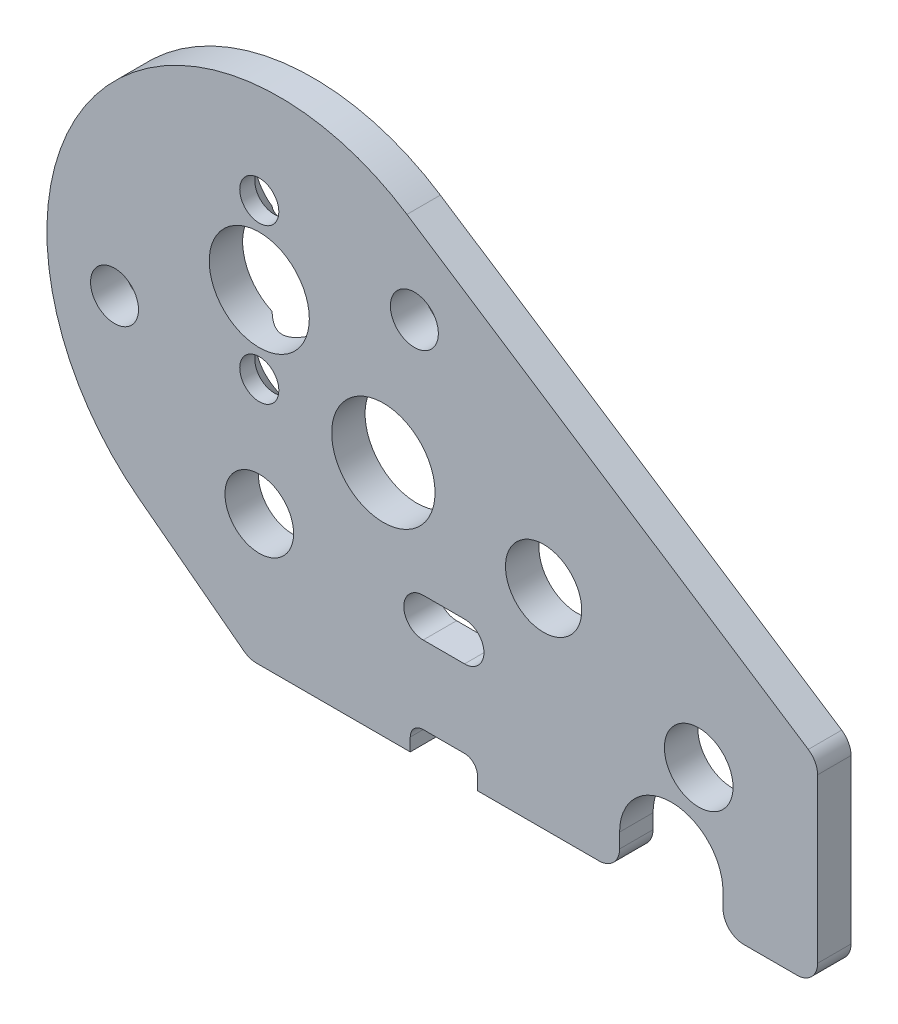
ISO-10303-21;
HEADER;
FILE_DESCRIPTION(('STEP AP214'),'2;1');
FILE_NAME('part.step','',(''),(''),'','','');
FILE_SCHEMA(('AUTOMOTIVE_DESIGN { 1 0 10303 214 1 1 1 1 }'));
ENDSEC;
DATA;
#1=APPLICATION_CONTEXT('core data for automotive mechanical design processes');
#2=APPLICATION_PROTOCOL_DEFINITION('international standard','automotive_design',2000,#1);
#3=PRODUCT_CONTEXT('',#1,'mechanical');
#4=PRODUCT('Part','Part','',(#3));
#5=PRODUCT_RELATED_PRODUCT_CATEGORY('part','',(#4));
#6=PRODUCT_DEFINITION_FORMATION('','',#4);
#7=PRODUCT_DEFINITION_CONTEXT('part definition',#1,'design');
#8=PRODUCT_DEFINITION('design','',#6,#7);
#9=PRODUCT_DEFINITION_SHAPE('','',#8);
#10=(LENGTH_UNIT() NAMED_UNIT(*) SI_UNIT(.MILLI.,.METRE.));
#11=(NAMED_UNIT(*) PLANE_ANGLE_UNIT() SI_UNIT($,.RADIAN.));
#12=(NAMED_UNIT(*) SI_UNIT($,.STERADIAN.) SOLID_ANGLE_UNIT());
#13=UNCERTAINTY_MEASURE_WITH_UNIT(LENGTH_MEASURE(1.E-05),#10,'distance_accuracy_value','');
#14=(GEOMETRIC_REPRESENTATION_CONTEXT(3) GLOBAL_UNCERTAINTY_ASSIGNED_CONTEXT((#13)) GLOBAL_UNIT_ASSIGNED_CONTEXT((#10,
#11,#12)) REPRESENTATION_CONTEXT('',''));
#15=CARTESIAN_POINT('',(0.,0.,0.));
#16=DIRECTION('',(0.,0.,1.));
#17=DIRECTION('',(1.,0.,0.));
#18=AXIS2_PLACEMENT_3D('',#15,#16,#17);
#19=CARTESIAN_POINT('',(34.29,-19.939,-2.05232));
#20=DIRECTION('',(0.,-1.,0.));
#21=DIRECTION('',(1.,0.,0.));
#22=AXIS2_PLACEMENT_3D('',#19,#20,#21);
#23=PLANE('',#22);
#24=DIRECTION('',(0.,0.,-1.));
#25=VECTOR('',#24,1.);
#26=CARTESIAN_POINT('',(9.27174263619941,-19.939,0.));
#27=LINE('',#26,#25);
#28=CARTESIAN_POINT('',(9.27174263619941,-19.939,0.));
#29=VERTEX_POINT('',#28);
#30=CARTESIAN_POINT('',(9.27174263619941,-19.939,-2.05232));
#31=VERTEX_POINT('',#30);
#32=EDGE_CURVE('E257',#29,#31,#27,.T.);
#33=ORIENTED_EDGE('',*,*,#32,.F.);
#34=DIRECTION('',(1.,0.,0.));
#35=VECTOR('',#34,1.);
#36=CARTESIAN_POINT('',(34.29,-19.939,0.));
#37=LINE('',#36,#35);
#38=CARTESIAN_POINT('',(-0.174773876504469,-19.939,0.));
#39=VERTEX_POINT('',#38);
#40=EDGE_CURVE('E401',#39,#29,#37,.T.);
#41=ORIENTED_EDGE('',*,*,#40,.F.);
#42=DIRECTION('',(0.,0.,1.));
#43=VECTOR('',#42,1.);
#44=CARTESIAN_POINT('',(-0.174773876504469,-19.939,-2.05232));
#45=LINE('',#44,#43);
#46=CARTESIAN_POINT('',(-0.174773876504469,-19.939,-2.05232));
#47=VERTEX_POINT('',#46);
#48=EDGE_CURVE('E530',#39,#47,#45,.F.);
#49=ORIENTED_EDGE('',*,*,#48,.T.);
#50=DIRECTION('',(1.,0.,0.));
#51=VECTOR('',#50,1.);
#52=CARTESIAN_POINT('',(34.29,-19.939,-2.05232));
#53=LINE('',#52,#51);
#54=EDGE_CURVE('E385',#47,#31,#53,.T.);
#55=ORIENTED_EDGE('',*,*,#54,.T.);
#56=EDGE_LOOP('',(#33,#41,#49,#55));
#57=FACE_BOUND('',#56,.T.);
#58=ADVANCED_FACE('F42',(#57),#23,.T.);
#59=CARTESIAN_POINT('',(29.7504926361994,-19.939,-2.05232));
#60=VERTEX_POINT('',#59);
#61=CARTESIAN_POINT('',(33.02,-19.939,-2.05232));
#62=VERTEX_POINT('',#61);
#63=EDGE_CURVE('E384',#60,#62,#53,.T.);
#64=ORIENTED_EDGE('',*,*,#63,.T.);
#65=DIRECTION('',(0.,0.,1.));
#66=VECTOR('',#65,1.);
#67=CARTESIAN_POINT('',(33.02,-19.939,-2.05232));
#68=LINE('',#67,#66);
#69=CARTESIAN_POINT('',(33.02,-19.939,0.));
#70=VERTEX_POINT('',#69);
#71=EDGE_CURVE('E492',#62,#70,#68,.T.);
#72=ORIENTED_EDGE('',*,*,#71,.T.);
#73=CARTESIAN_POINT('',(29.7504926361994,-19.939,0.));
#74=VERTEX_POINT('',#73);
#75=EDGE_CURVE('E400',#74,#70,#37,.T.);
#76=ORIENTED_EDGE('',*,*,#75,.F.);
#77=DIRECTION('',(0.,0.,1.));
#78=VECTOR('',#77,1.);
#79=CARTESIAN_POINT('',(29.7504926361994,-19.939,-2.05232));
#80=LINE('',#79,#78);
#81=EDGE_CURVE('E495',#74,#60,#80,.F.);
#82=ORIENTED_EDGE('',*,*,#81,.T.);
#83=EDGE_LOOP('',(#64,#72,#76,#82));
#84=FACE_BOUND('',#83,.T.);
#85=ADVANCED_FACE('F451',(#84),#23,.T.);
#86=CARTESIAN_POINT('',(1.2446,-3.4036,-2.05232));
#87=DIRECTION('',(0.,0.,1.));
#88=DIRECTION('',(1.,0.,0.));
#89=AXIS2_PLACEMENT_3D('',#86,#87,#88);
#90=PLANE('',#89);
#91=DIRECTION('',(-1.,0.,0.));
#92=VECTOR('',#91,1.);
#93=CARTESIAN_POINT('',(12.6054926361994,-13.589,-2.05232));
#94=LINE('',#93,#92);
#95=CARTESIAN_POINT('',(12.6054926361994,-13.589,-2.05232));
#96=VERTEX_POINT('',#95);
#97=CARTESIAN_POINT('',(10.0654926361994,-13.589,-2.05232));
#98=VERTEX_POINT('',#97);
#99=EDGE_CURVE('E280',#96,#98,#94,.T.);
#100=ORIENTED_EDGE('',*,*,#99,.F.);
#101=CARTESIAN_POINT('',(12.6054926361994,-12.398375,-2.05232));
#102=DIRECTION('',(0.,0.,-1.));
#103=DIRECTION('',(-1.,0.,0.));
#104=AXIS2_PLACEMENT_3D('',#101,#102,#103);
#105=CIRCLE('',#104,1.190625);
#106=CARTESIAN_POINT('',(12.6054926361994,-11.20775,-2.05232));
#107=VERTEX_POINT('',#106);
#108=EDGE_CURVE('E65',#107,#96,#105,.T.);
#109=ORIENTED_EDGE('',*,*,#108,.F.);
#110=DIRECTION('',(1.,0.,0.));
#111=VECTOR('',#110,1.);
#112=CARTESIAN_POINT('',(12.6054926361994,-11.20775,-2.05232));
#113=LINE('',#112,#111);
#114=CARTESIAN_POINT('',(10.0654926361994,-11.20775,-2.05232));
#115=VERTEX_POINT('',#114);
#116=EDGE_CURVE('E269',#115,#107,#113,.T.);
#117=ORIENTED_EDGE('',*,*,#116,.F.);
#118=CARTESIAN_POINT('',(10.0654926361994,-12.398375,-2.05232));
#119=DIRECTION('',(0.,0.,-1.));
#120=DIRECTION('',(-1.,0.,0.));
#121=AXIS2_PLACEMENT_3D('',#118,#119,#120);
#122=CIRCLE('',#121,1.190625);
#123=EDGE_CURVE('E283',#98,#115,#122,.T.);
#124=ORIENTED_EDGE('',*,*,#123,.F.);
#125=EDGE_LOOP('',(#100,#109,#117,#124));
#126=FACE_BOUND('',#125,.T.);
#127=CARTESIAN_POINT('',(7.62,-5.3848,-2.05232));
#128=DIRECTION('',(0.,0.,1.));
#129=DIRECTION('',(1.,0.,0.));
#130=AXIS2_PLACEMENT_3D('',#127,#128,#129);
#131=CIRCLE('',#130,3.175);
#132=CARTESIAN_POINT('',(10.795,-5.3848,-2.05232));
#133=VERTEX_POINT('',#132);
#134=EDGE_CURVE('E317',#133,#133,#131,.T.);
#135=ORIENTED_EDGE('',*,*,#134,.T.);
#136=EDGE_LOOP('',(#135));
#137=FACE_BOUND('',#136,.T.);
#138=CARTESIAN_POINT('',(9.525,3.175,-2.05232));
#139=DIRECTION('',(0.,0.,1.));
#140=DIRECTION('',(1.,0.,0.));
#141=AXIS2_PLACEMENT_3D('',#138,#139,#140);
#142=CIRCLE('',#141,1.4732);
#143=CARTESIAN_POINT('',(10.9982,3.175,-2.05232));
#144=VERTEX_POINT('',#143);
#145=EDGE_CURVE('E325',#144,#144,#142,.T.);
#146=ORIENTED_EDGE('',*,*,#145,.T.);
#147=EDGE_LOOP('',(#146));
#148=FACE_BOUND('',#147,.T.);
#149=CARTESIAN_POINT('',(-8.89,-4.7625,-2.05232));
#150=DIRECTION('',(0.,0.,1.));
#151=DIRECTION('',(1.,0.,0.));
#152=AXIS2_PLACEMENT_3D('',#149,#150,#151);
#153=CIRCLE('',#152,1.4732);
#154=CARTESIAN_POINT('',(-7.4168,-4.7625,-2.05232));
#155=VERTEX_POINT('',#154);
#156=EDGE_CURVE('E331',#155,#155,#153,.T.);
#157=ORIENTED_EDGE('',*,*,#156,.T.);
#158=EDGE_LOOP('',(#157));
#159=FACE_BOUND('',#158,.T.);
#160=CARTESIAN_POINT('',(0.,-11.90625,-2.05232));
#161=DIRECTION('',(0.,0.,1.));
#162=DIRECTION('',(1.,0.,0.));
#163=AXIS2_PLACEMENT_3D('',#160,#161,#162);
#164=CIRCLE('',#163,2.1082);
#165=CARTESIAN_POINT('',(2.1082,-11.90625,-2.05232));
#166=VERTEX_POINT('',#165);
#167=EDGE_CURVE('E337',#166,#166,#164,.T.);
#168=ORIENTED_EDGE('',*,*,#167,.T.);
#169=EDGE_LOOP('',(#168));
#170=FACE_BOUND('',#169,.T.);
#171=CARTESIAN_POINT('',(26.9875,-11.90625,-2.05232));
#172=DIRECTION('',(0.,0.,1.));
#173=DIRECTION('',(1.,0.,0.));
#174=AXIS2_PLACEMENT_3D('',#171,#172,#173);
#175=CIRCLE('',#174,2.1082);
#176=CARTESIAN_POINT('',(29.0957,-11.90625,-2.05232));
#177=VERTEX_POINT('',#176);
#178=EDGE_CURVE('E343',#177,#177,#175,.T.);
#179=ORIENTED_EDGE('',*,*,#178,.T.);
#180=EDGE_LOOP('',(#179));
#181=FACE_BOUND('',#180,.T.);
#182=CARTESIAN_POINT('',(17.4625,-7.14375,-2.05232));
#183=DIRECTION('',(0.,0.,1.));
#184=DIRECTION('',(1.,0.,0.));
#185=AXIS2_PLACEMENT_3D('',#182,#183,#184);
#186=CIRCLE('',#185,2.34103513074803);
#187=CARTESIAN_POINT('',(19.803535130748,-7.14375,-2.05232));
#188=VERTEX_POINT('',#187);
#189=EDGE_CURVE('E364',#188,#188,#186,.T.);
#190=ORIENTED_EDGE('',*,*,#189,.T.);
#191=EDGE_LOOP('',(#190));
#192=FACE_BOUND('',#191,.T.);
#193=CARTESIAN_POINT('',(10.0654926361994,-19.14525,-2.05232));
#194=DIRECTION('',(0.,0.,-1.));
#195=DIRECTION('',(1.,0.,0.));
#196=AXIS2_PLACEMENT_3D('',#193,#194,#195);
#197=CIRCLE('',#196,0.793749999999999);
#198=CARTESIAN_POINT('',(9.27174263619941,-19.14525,-2.05232));
#199=VERTEX_POINT('',#198);
#200=CARTESIAN_POINT('',(10.0654926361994,-18.3515,-2.05232));
#201=VERTEX_POINT('',#200);
#202=EDGE_CURVE('E222',#199,#201,#197,.T.);
#203=ORIENTED_EDGE('',*,*,#202,.F.);
#204=DIRECTION('',(0.,1.,0.));
#205=VECTOR('',#204,1.);
#206=CARTESIAN_POINT('',(9.27174263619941,-19.939,-2.05232));
#207=LINE('',#206,#205);
#208=EDGE_CURVE('E237',#31,#199,#207,.T.);
#209=ORIENTED_EDGE('',*,*,#208,.F.);
#210=ORIENTED_EDGE('',*,*,#54,.F.);
#211=CARTESIAN_POINT('',(-0.174773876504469,-18.669,-2.05232));
#212=DIRECTION('',(0.,0.,1.));
#213=DIRECTION('',(1.,0.,0.));
#214=AXIS2_PLACEMENT_3D('',#211,#212,#213);
#215=CIRCLE('',#214,1.27);
#216=CARTESIAN_POINT('',(-0.942614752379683,-19.6805929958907,-2.05232));
#217=VERTEX_POINT('',#216);
#218=EDGE_CURVE('E519',#47,#217,#215,.F.);
#219=ORIENTED_EDGE('',*,*,#218,.T.);
#220=DIRECTION('',(0.7965299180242,-0.60459911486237,0.));
#221=VECTOR('',#220,1.);
#222=CARTESIAN_POINT('',(-7.39360985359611,-14.7840212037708,-2.05232));
#223=LINE('',#222,#221);
#224=CARTESIAN_POINT('',(-7.39360985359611,-14.7840212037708,-2.05232));
#225=VERTEX_POINT('',#224);
#226=EDGE_CURVE('E380',#225,#217,#223,.T.);
#227=ORIENTED_EDGE('',*,*,#226,.F.);
#228=CARTESIAN_POINT('',(1.2446,-3.4036,-2.05232));
#229=DIRECTION('',(0.,0.,1.));
#230=DIRECTION('',(1.,0.,0.));
#231=AXIS2_PLACEMENT_3D('',#228,#229,#230);
#232=CIRCLE('',#231,14.2875);
#233=CARTESIAN_POINT('',(9.06999602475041,8.55030452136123,-2.05232));
#234=VERTEX_POINT('',#233);
#235=EDGE_CURVE('E377',#234,#225,#232,.T.);
#236=ORIENTED_EDGE('',*,*,#235,.F.);
#237=DIRECTION('',(-0.836668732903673,0.547709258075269,0.));
#238=VECTOR('',#237,1.);
#239=CARTESIAN_POINT('',(9.06999602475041,8.55030452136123,-2.05232));
#240=LINE('',#239,#238);
#241=CARTESIAN_POINT('',(33.7155907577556,-7.58346488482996,-2.05232));
#242=VERTEX_POINT('',#241);
#243=EDGE_CURVE('E392',#242,#234,#240,.T.);
#244=ORIENTED_EDGE('',*,*,#243,.F.);
#245=CARTESIAN_POINT('',(33.02,-8.64603417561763,-2.05232));
#246=DIRECTION('',(0.,0.,1.));
#247=DIRECTION('',(1.,0.,0.));
#248=AXIS2_PLACEMENT_3D('',#245,#246,#247);
#249=CIRCLE('',#248,1.27);
#250=CARTESIAN_POINT('',(34.29,-8.64603417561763,-2.05232));
#251=VERTEX_POINT('',#250);
#252=EDGE_CURVE('E521',#242,#251,#249,.F.);
#253=ORIENTED_EDGE('',*,*,#252,.T.);
#254=DIRECTION('',(0.,1.,0.));
#255=VECTOR('',#254,1.);
#256=CARTESIAN_POINT('',(34.29,-19.939,-2.05232));
#257=LINE('',#256,#255);
#258=CARTESIAN_POINT('',(34.29,-18.669,-2.05232));
#259=VERTEX_POINT('',#258);
#260=EDGE_CURVE('E388',#259,#251,#257,.T.);
#261=ORIENTED_EDGE('',*,*,#260,.F.);
#262=CARTESIAN_POINT('',(33.02,-18.669,-2.05232));
#263=DIRECTION('',(0.,0.,1.));
#264=DIRECTION('',(1.,0.,0.));
#265=AXIS2_PLACEMENT_3D('',#262,#263,#264);
#266=CIRCLE('',#265,1.27);
#267=EDGE_CURVE('E501',#259,#62,#266,.F.);
#268=ORIENTED_EDGE('',*,*,#267,.T.);
#269=ORIENTED_EDGE('',*,*,#63,.F.);
#270=CARTESIAN_POINT('',(29.7504926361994,-18.669,-2.05232));
#271=DIRECTION('',(0.,0.,1.));
#272=DIRECTION('',(1.,0.,0.));
#273=AXIS2_PLACEMENT_3D('',#270,#271,#272);
#274=CIRCLE('',#273,1.27);
#275=CARTESIAN_POINT('',(28.4804926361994,-18.669,-2.05232));
#276=VERTEX_POINT('',#275);
#277=EDGE_CURVE('E524',#60,#276,#274,.F.);
#278=ORIENTED_EDGE('',*,*,#277,.T.);
#279=DIRECTION('',(0.,1.,0.));
#280=VECTOR('',#279,1.);
#281=CARTESIAN_POINT('',(28.4804926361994,-17.768315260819,-2.05232));
#282=LINE('',#281,#280);
#283=CARTESIAN_POINT('',(28.4804926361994,-17.768315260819,-2.05232));
#284=VERTEX_POINT('',#283);
#285=EDGE_CURVE('E303',#276,#284,#282,.T.);
#286=ORIENTED_EDGE('',*,*,#285,.T.);
#287=CARTESIAN_POINT('',(25.3054926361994,-17.768315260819,-2.05232));
#288=DIRECTION('',(0.,0.,1.));
#289=DIRECTION('',(1.,0.,0.));
#290=AXIS2_PLACEMENT_3D('',#287,#288,#289);
#291=CIRCLE('',#290,3.175);
#292=CARTESIAN_POINT('',(22.1304926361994,-17.768315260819,-2.05232));
#293=VERTEX_POINT('',#292);
#294=EDGE_CURVE('E296',#284,#293,#291,.T.);
#295=ORIENTED_EDGE('',*,*,#294,.T.);
#296=DIRECTION('',(0.,-1.,0.));
#297=VECTOR('',#296,1.);
#298=CARTESIAN_POINT('',(22.1304926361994,-17.768315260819,-2.05232));
#299=LINE('',#298,#297);
#300=CARTESIAN_POINT('',(22.1304926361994,-18.669,-2.05232));
#301=VERTEX_POINT('',#300);
#302=EDGE_CURVE('E299',#293,#301,#299,.T.);
#303=ORIENTED_EDGE('',*,*,#302,.T.);
#304=CARTESIAN_POINT('',(20.8604926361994,-18.669,-2.05232));
#305=DIRECTION('',(0.,0.,1.));
#306=DIRECTION('',(1.,0.,0.));
#307=AXIS2_PLACEMENT_3D('',#304,#305,#306);
#308=CIRCLE('',#307,1.27);
#309=CARTESIAN_POINT('',(20.8604926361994,-19.939,-2.05232));
#310=VERTEX_POINT('',#309);
#311=EDGE_CURVE('E485',#301,#310,#308,.F.);
#312=ORIENTED_EDGE('',*,*,#311,.T.);
#313=CARTESIAN_POINT('',(13.3992426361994,-19.939,-2.05232));
#314=VERTEX_POINT('',#313);
#315=EDGE_CURVE('E389',#314,#310,#53,.T.);
#316=ORIENTED_EDGE('',*,*,#315,.F.);
#317=DIRECTION('',(0.,-1.,0.));
#318=VECTOR('',#317,1.);
#319=CARTESIAN_POINT('',(13.3992426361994,-19.939,-2.05232));
#320=LINE('',#319,#318);
#321=CARTESIAN_POINT('',(13.3992426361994,-19.14525,-2.05232));
#322=VERTEX_POINT('',#321);
#323=EDGE_CURVE('E240',#322,#314,#320,.T.);
#324=ORIENTED_EDGE('',*,*,#323,.F.);
#325=CARTESIAN_POINT('',(12.6054926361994,-19.14525,-2.05232));
#326=DIRECTION('',(0.,0.,-1.));
#327=DIRECTION('',(1.,0.,0.));
#328=AXIS2_PLACEMENT_3D('',#325,#326,#327);
#329=CIRCLE('',#328,0.79375);
#330=CARTESIAN_POINT('',(12.6054926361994,-18.3515,-2.05232));
#331=VERTEX_POINT('',#330);
#332=EDGE_CURVE('E251',#331,#322,#329,.T.);
#333=ORIENTED_EDGE('',*,*,#332,.F.);
#334=DIRECTION('',(1.,0.,0.));
#335=VECTOR('',#334,1.);
#336=CARTESIAN_POINT('',(12.6054926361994,-18.3515,-2.05232));
#337=LINE('',#336,#335);
#338=EDGE_CURVE('E249',#201,#331,#337,.T.);
#339=ORIENTED_EDGE('',*,*,#338,.F.);
#340=EDGE_LOOP('',(#203,#209,#210,#219,#227,#236,#244,#253,#261,#268,#269,#278,#286,#295,#303,
#312,#316,#324,#333,#339));
#341=FACE_BOUND('',#340,.T.);
#342=CARTESIAN_POINT('',(0.,4.7498,-2.05232));
#343=DIRECTION('',(0.,0.,-1.));
#344=DIRECTION('',(-1.,0.,0.));
#345=AXIS2_PLACEMENT_3D('',#342,#343,#344);
#346=CIRCLE('',#345,2.327);
#347=CARTESIAN_POINT('',(-1.2689215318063,2.79921876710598,-2.05232));
#348=VERTEX_POINT('',#347);
#349=CARTESIAN_POINT('',(1.26892153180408,2.79921876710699,-2.05232));
#350=VERTEX_POINT('',#349);
#351=EDGE_CURVE('E346',#348,#350,#346,.T.);
#352=ORIENTED_EDGE('',*,*,#351,.F.);
#353=CARTESIAN_POINT('',(0.,0.,-2.05232));
#354=DIRECTION('',(0.,0.,1.));
#355=DIRECTION('',(1.,0.,0.));
#356=AXIS2_PLACEMENT_3D('',#353,#354,#355);
#357=CIRCLE('',#356,3.0734);
#358=CARTESIAN_POINT('',(-1.2689215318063,-2.79921876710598,-2.05232));
#359=VERTEX_POINT('',#358);
#360=EDGE_CURVE('E374',#348,#359,#357,.T.);
#361=ORIENTED_EDGE('',*,*,#360,.T.);
#362=CARTESIAN_POINT('',(0.,-4.7498,-2.05232));
#363=DIRECTION('',(0.,0.,-1.));
#364=DIRECTION('',(-1.,0.,0.));
#365=AXIS2_PLACEMENT_3D('',#362,#363,#364);
#366=CIRCLE('',#365,2.327);
#367=CARTESIAN_POINT('',(1.2689215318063,-2.79921876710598,-2.05232));
#368=VERTEX_POINT('',#367);
#369=EDGE_CURVE('E354',#368,#359,#366,.T.);
#370=ORIENTED_EDGE('',*,*,#369,.F.);
#371=EDGE_CURVE('E370',#368,#350,#357,.T.);
#372=ORIENTED_EDGE('',*,*,#371,.T.);
#373=EDGE_LOOP('',(#352,#361,#370,#372));
#374=FACE_BOUND('',#373,.T.);
#375=ADVANCED_FACE('F458',(#126,#137,#148,#159,#170,#181,#192,#341,#374),#90,.F.);
#376=CARTESIAN_POINT('',(1.2446,-3.4036,-2.05232));
#377=DIRECTION('',(0.,0.,1.));
#378=DIRECTION('',(1.,0.,0.));
#379=AXIS2_PLACEMENT_3D('',#376,#377,#378);
#380=CYLINDRICAL_SURFACE('',#379,14.2875);
#381=CARTESIAN_POINT('',(1.2446,-3.4036,0.));
#382=DIRECTION('',(0.,0.,1.));
#383=DIRECTION('',(1.,0.,0.));
#384=AXIS2_PLACEMENT_3D('',#381,#382,#383);
#385=CIRCLE('',#384,14.2875);
#386=CARTESIAN_POINT('',(9.06999602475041,8.55030452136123,0.));
#387=VERTEX_POINT('',#386);
#388=CARTESIAN_POINT('',(-7.39360985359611,-14.7840212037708,0.));
#389=VERTEX_POINT('',#388);
#390=EDGE_CURVE('E373',#387,#389,#385,.T.);
#391=ORIENTED_EDGE('',*,*,#390,.F.);
#392=DIRECTION('',(0.,0.,1.));
#393=VECTOR('',#392,1.);
#394=CARTESIAN_POINT('',(9.06999602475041,8.55030452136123,-2.05232));
#395=LINE('',#394,#393);
#396=EDGE_CURVE('E408',#234,#387,#395,.T.);
#397=ORIENTED_EDGE('',*,*,#396,.F.);
#398=ORIENTED_EDGE('',*,*,#235,.T.);
#399=DIRECTION('',(0.,0.,1.));
#400=VECTOR('',#399,1.);
#401=CARTESIAN_POINT('',(-7.39360985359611,-14.7840212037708,-2.05232));
#402=LINE('',#401,#400);
#403=EDGE_CURVE('E394',#225,#389,#402,.T.);
#404=ORIENTED_EDGE('',*,*,#403,.T.);
#405=EDGE_LOOP('',(#391,#397,#398,#404));
#406=FACE_BOUND('',#405,.T.);
#407=ADVANCED_FACE('F596',(#406),#380,.T.);
#408=CARTESIAN_POINT('',(9.06999602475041,8.55030452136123,-2.05232));
#409=DIRECTION('',(0.547709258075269,0.836668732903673,0.));
#410=DIRECTION('',(-0.836668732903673,0.547709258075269,0.));
#411=AXIS2_PLACEMENT_3D('',#408,#409,#410);
#412=PLANE('',#411);
#413=DIRECTION('',(-0.836668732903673,0.547709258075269,0.));
#414=VECTOR('',#413,1.);
#415=CARTESIAN_POINT('',(9.06999602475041,8.55030452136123,0.));
#416=LINE('',#415,#414);
#417=CARTESIAN_POINT('',(33.7155907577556,-7.58346488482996,0.));
#418=VERTEX_POINT('',#417);
#419=EDGE_CURVE('E381',#418,#387,#416,.T.);
#420=ORIENTED_EDGE('',*,*,#419,.F.);
#421=DIRECTION('',(0.,0.,1.));
#422=VECTOR('',#421,1.);
#423=CARTESIAN_POINT('',(33.7155907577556,-7.58346488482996,-2.05232));
#424=LINE('',#423,#422);
#425=EDGE_CURVE('E50',#418,#242,#424,.F.);
#426=ORIENTED_EDGE('',*,*,#425,.T.);
#427=ORIENTED_EDGE('',*,*,#243,.T.);
#428=ORIENTED_EDGE('',*,*,#396,.T.);
#429=EDGE_LOOP('',(#420,#426,#427,#428));
#430=FACE_BOUND('',#429,.T.);
#431=ADVANCED_FACE('F472',(#430),#412,.T.);
#432=CARTESIAN_POINT('',(34.29,-19.939,-2.05232));
#433=DIRECTION('',(1.,0.,0.));
#434=DIRECTION('',(0.,0.,-1.));
#435=AXIS2_PLACEMENT_3D('',#432,#433,#434);
#436=PLANE('',#435);
#437=DIRECTION('',(0.,1.,0.));
#438=VECTOR('',#437,1.);
#439=CARTESIAN_POINT('',(34.29,-19.939,0.));
#440=LINE('',#439,#438);
#441=CARTESIAN_POINT('',(34.29,-18.669,0.));
#442=VERTEX_POINT('',#441);
#443=CARTESIAN_POINT('',(34.29,-8.64603417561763,0.));
#444=VERTEX_POINT('',#443);
#445=EDGE_CURVE('E403',#442,#444,#440,.T.);
#446=ORIENTED_EDGE('',*,*,#445,.F.);
#447=DIRECTION('',(0.,0.,1.));
#448=VECTOR('',#447,1.);
#449=CARTESIAN_POINT('',(34.29,-18.669,-2.05232));
#450=LINE('',#449,#448);
#451=EDGE_CURVE('E517',#442,#259,#450,.F.);
#452=ORIENTED_EDGE('',*,*,#451,.T.);
#453=ORIENTED_EDGE('',*,*,#260,.T.);
#454=DIRECTION('',(0.,0.,1.));
#455=VECTOR('',#454,1.);
#456=CARTESIAN_POINT('',(34.29,-8.64603417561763,-2.05232));
#457=LINE('',#456,#455);
#458=EDGE_CURVE('E514',#251,#444,#457,.T.);
#459=ORIENTED_EDGE('',*,*,#458,.T.);
#460=EDGE_LOOP('',(#446,#452,#453,#459));
#461=FACE_BOUND('',#460,.T.);
#462=ADVANCED_FACE('F465',(#461),#436,.T.);
#463=DIRECTION('',(0.,0.,-1.));
#464=VECTOR('',#463,1.);
#465=CARTESIAN_POINT('',(13.3992426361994,-19.939,0.));
#466=LINE('',#465,#464);
#467=CARTESIAN_POINT('',(13.3992426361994,-19.939,0.));
#468=VERTEX_POINT('',#467);
#469=EDGE_CURVE('E259',#468,#314,#466,.T.);
#470=ORIENTED_EDGE('',*,*,#469,.T.);
#471=ORIENTED_EDGE('',*,*,#315,.T.);
#472=DIRECTION('',(0.,0.,1.));
#473=VECTOR('',#472,1.);
#474=CARTESIAN_POINT('',(20.8604926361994,-19.939,0.));
#475=LINE('',#474,#473);
#476=CARTESIAN_POINT('',(20.8604926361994,-19.939,0.));
#477=VERTEX_POINT('',#476);
#478=EDGE_CURVE('E532',#310,#477,#475,.T.);
#479=ORIENTED_EDGE('',*,*,#478,.T.);
#480=EDGE_CURVE('E404',#468,#477,#37,.T.);
#481=ORIENTED_EDGE('',*,*,#480,.F.);
#482=EDGE_LOOP('',(#470,#471,#479,#481));
#483=FACE_BOUND('',#482,.T.);
#484=ADVANCED_FACE('F454',(#483),#23,.T.);
#485=CARTESIAN_POINT('',(-7.39360985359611,-14.7840212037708,-2.05232));
#486=DIRECTION('',(-0.60459911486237,-0.7965299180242,0.));
#487=DIRECTION('',(0.7965299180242,-0.60459911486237,0.));
#488=AXIS2_PLACEMENT_3D('',#485,#486,#487);
#489=PLANE('',#488);
#490=ORIENTED_EDGE('',*,*,#226,.T.);
#491=DIRECTION('',(0.,0.,1.));
#492=VECTOR('',#491,1.);
#493=CARTESIAN_POINT('',(-0.942614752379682,-19.6805929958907,-2.05232));
#494=LINE('',#493,#492);
#495=CARTESIAN_POINT('',(-0.942614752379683,-19.6805929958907,0.));
#496=VERTEX_POINT('',#495);
#497=EDGE_CURVE('E11',#217,#496,#494,.T.);
#498=ORIENTED_EDGE('',*,*,#497,.T.);
#499=DIRECTION('',(0.7965299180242,-0.60459911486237,0.));
#500=VECTOR('',#499,1.);
#501=CARTESIAN_POINT('',(-7.39360985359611,-14.7840212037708,0.));
#502=LINE('',#501,#500);
#503=EDGE_CURVE('E397',#389,#496,#502,.T.);
#504=ORIENTED_EDGE('',*,*,#503,.F.);
#505=ORIENTED_EDGE('',*,*,#403,.F.);
#506=EDGE_LOOP('',(#490,#498,#504,#505));
#507=FACE_BOUND('',#506,.T.);
#508=ADVANCED_FACE('F464',(#507),#489,.T.);
#509=CARTESIAN_POINT('',(1.2446,-3.4036,0.));
#510=DIRECTION('',(0.,0.,1.));
#511=DIRECTION('',(1.,0.,0.));
#512=AXIS2_PLACEMENT_3D('',#509,#510,#511);
#513=PLANE('',#512);
#514=DIRECTION('',(0.,1.,0.));
#515=VECTOR('',#514,1.);
#516=CARTESIAN_POINT('',(9.27174263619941,-19.939,0.));
#517=LINE('',#516,#515);
#518=CARTESIAN_POINT('',(9.27174263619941,-19.14525,0.));
#519=VERTEX_POINT('',#518);
#520=EDGE_CURVE('E227',#29,#519,#517,.T.);
#521=ORIENTED_EDGE('',*,*,#520,.T.);
#522=CARTESIAN_POINT('',(10.0654926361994,-19.14525,0.));
#523=DIRECTION('',(0.,0.,-1.));
#524=DIRECTION('',(1.,0.,0.));
#525=AXIS2_PLACEMENT_3D('',#522,#523,#524);
#526=CIRCLE('',#525,0.793749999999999);
#527=CARTESIAN_POINT('',(10.0654926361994,-18.3515,0.));
#528=VERTEX_POINT('',#527);
#529=EDGE_CURVE('E219',#519,#528,#526,.T.);
#530=ORIENTED_EDGE('',*,*,#529,.T.);
#531=DIRECTION('',(1.,0.,0.));
#532=VECTOR('',#531,1.);
#533=CARTESIAN_POINT('',(12.6054926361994,-18.3515,0.));
#534=LINE('',#533,#532);
#535=CARTESIAN_POINT('',(12.6054926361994,-18.3515,0.));
#536=VERTEX_POINT('',#535);
#537=EDGE_CURVE('E230',#528,#536,#534,.T.);
#538=ORIENTED_EDGE('',*,*,#537,.T.);
#539=CARTESIAN_POINT('',(12.6054926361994,-19.14525,0.));
#540=DIRECTION('',(0.,0.,-1.));
#541=DIRECTION('',(1.,0.,0.));
#542=AXIS2_PLACEMENT_3D('',#539,#540,#541);
#543=CIRCLE('',#542,0.79375);
#544=CARTESIAN_POINT('',(13.3992426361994,-19.14525,0.));
#545=VERTEX_POINT('',#544);
#546=EDGE_CURVE('E57',#536,#545,#543,.T.);
#547=ORIENTED_EDGE('',*,*,#546,.T.);
#548=DIRECTION('',(0.,-1.,0.));
#549=VECTOR('',#548,1.);
#550=CARTESIAN_POINT('',(13.3992426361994,-19.939,0.));
#551=LINE('',#550,#549);
#552=EDGE_CURVE('E244',#545,#468,#551,.T.);
#553=ORIENTED_EDGE('',*,*,#552,.T.);
#554=ORIENTED_EDGE('',*,*,#480,.T.);
#555=CARTESIAN_POINT('',(20.8604926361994,-18.669,0.));
#556=DIRECTION('',(0.,0.,1.));
#557=DIRECTION('',(1.,0.,0.));
#558=AXIS2_PLACEMENT_3D('',#555,#556,#557);
#559=CIRCLE('',#558,1.27);
#560=CARTESIAN_POINT('',(22.1304926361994,-18.669,0.));
#561=VERTEX_POINT('',#560);
#562=EDGE_CURVE('E509',#477,#561,#559,.T.);
#563=ORIENTED_EDGE('',*,*,#562,.T.);
#564=DIRECTION('',(0.,-1.,0.));
#565=VECTOR('',#564,1.);
#566=CARTESIAN_POINT('',(22.1304926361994,-17.768315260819,0.));
#567=LINE('',#566,#565);
#568=CARTESIAN_POINT('',(22.1304926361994,-17.768315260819,0.));
#569=VERTEX_POINT('',#568);
#570=EDGE_CURVE('E307',#569,#561,#567,.T.);
#571=ORIENTED_EDGE('',*,*,#570,.F.);
#572=CARTESIAN_POINT('',(25.3054926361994,-17.768315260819,0.));
#573=DIRECTION('',(0.,0.,1.));
#574=DIRECTION('',(1.,0.,0.));
#575=AXIS2_PLACEMENT_3D('',#572,#573,#574);
#576=CIRCLE('',#575,3.175);
#577=CARTESIAN_POINT('',(28.4804926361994,-17.768315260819,0.));
#578=VERTEX_POINT('',#577);
#579=EDGE_CURVE('E290',#578,#569,#576,.T.);
#580=ORIENTED_EDGE('',*,*,#579,.F.);
#581=DIRECTION('',(0.,1.,0.));
#582=VECTOR('',#581,1.);
#583=CARTESIAN_POINT('',(28.4804926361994,-17.768315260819,0.));
#584=LINE('',#583,#582);
#585=CARTESIAN_POINT('',(28.4804926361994,-18.669,0.));
#586=VERTEX_POINT('',#585);
#587=EDGE_CURVE('E300',#586,#578,#584,.T.);
#588=ORIENTED_EDGE('',*,*,#587,.F.);
#589=CARTESIAN_POINT('',(29.7504926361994,-18.669,0.));
#590=DIRECTION('',(0.,0.,1.));
#591=DIRECTION('',(1.,0.,0.));
#592=AXIS2_PLACEMENT_3D('',#589,#590,#591);
#593=CIRCLE('',#592,1.27);
#594=EDGE_CURVE('E511',#586,#74,#593,.T.);
#595=ORIENTED_EDGE('',*,*,#594,.T.);
#596=ORIENTED_EDGE('',*,*,#75,.T.);
#597=CARTESIAN_POINT('',(33.02,-18.669,0.));
#598=DIRECTION('',(0.,0.,1.));
#599=DIRECTION('',(1.,0.,0.));
#600=AXIS2_PLACEMENT_3D('',#597,#598,#599);
#601=CIRCLE('',#600,1.27);
#602=EDGE_CURVE('E502',#70,#442,#601,.T.);
#603=ORIENTED_EDGE('',*,*,#602,.T.);
#604=ORIENTED_EDGE('',*,*,#445,.T.);
#605=CARTESIAN_POINT('',(33.02,-8.64603417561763,0.));
#606=DIRECTION('',(0.,0.,1.));
#607=DIRECTION('',(1.,0.,0.));
#608=AXIS2_PLACEMENT_3D('',#605,#606,#607);
#609=CIRCLE('',#608,1.27);
#610=EDGE_CURVE('E505',#444,#418,#609,.T.);
#611=ORIENTED_EDGE('',*,*,#610,.T.);
#612=ORIENTED_EDGE('',*,*,#419,.T.);
#613=ORIENTED_EDGE('',*,*,#390,.T.);
#614=ORIENTED_EDGE('',*,*,#503,.T.);
#615=CARTESIAN_POINT('',(-0.174773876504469,-18.669,0.));
#616=DIRECTION('',(0.,0.,1.));
#617=DIRECTION('',(1.,0.,0.));
#618=AXIS2_PLACEMENT_3D('',#615,#616,#617);
#619=CIRCLE('',#618,1.27);
#620=EDGE_CURVE('E503',#496,#39,#619,.T.);
#621=ORIENTED_EDGE('',*,*,#620,.T.);
#622=ORIENTED_EDGE('',*,*,#40,.T.);
#623=EDGE_LOOP('',(#521,#530,#538,#547,#553,#554,#563,#571,#580,#588,#595,#596,#603,#604,#611,
#612,#613,#614,#621,#622));
#624=FACE_BOUND('',#623,.T.);
#625=CARTESIAN_POINT('',(12.6054926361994,-12.398375,0.));
#626=DIRECTION('',(0.,0.,-1.));
#627=DIRECTION('',(-1.,0.,0.));
#628=AXIS2_PLACEMENT_3D('',#625,#626,#627);
#629=CIRCLE('',#628,1.190625);
#630=CARTESIAN_POINT('',(12.6054926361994,-11.20775,0.));
#631=VERTEX_POINT('',#630);
#632=CARTESIAN_POINT('',(12.6054926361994,-13.589,0.));
#633=VERTEX_POINT('',#632);
#634=EDGE_CURVE('E265',#631,#633,#629,.T.);
#635=ORIENTED_EDGE('',*,*,#634,.T.);
#636=DIRECTION('',(-1.,0.,0.));
#637=VECTOR('',#636,1.);
#638=CARTESIAN_POINT('',(12.6054926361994,-13.589,0.));
#639=LINE('',#638,#637);
#640=CARTESIAN_POINT('',(10.0654926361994,-13.589,0.));
#641=VERTEX_POINT('',#640);
#642=EDGE_CURVE('E268',#633,#641,#639,.T.);
#643=ORIENTED_EDGE('',*,*,#642,.T.);
#644=CARTESIAN_POINT('',(10.0654926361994,-12.398375,0.));
#645=DIRECTION('',(0.,0.,-1.));
#646=DIRECTION('',(-1.,0.,0.));
#647=AXIS2_PLACEMENT_3D('',#644,#645,#646);
#648=CIRCLE('',#647,1.190625);
#649=CARTESIAN_POINT('',(10.0654926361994,-11.20775,0.));
#650=VERTEX_POINT('',#649);
#651=EDGE_CURVE('E272',#641,#650,#648,.T.);
#652=ORIENTED_EDGE('',*,*,#651,.T.);
#653=DIRECTION('',(1.,0.,0.));
#654=VECTOR('',#653,1.);
#655=CARTESIAN_POINT('',(12.6054926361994,-11.20775,0.));
#656=LINE('',#655,#654);
#657=EDGE_CURVE('E275',#650,#631,#656,.T.);
#658=ORIENTED_EDGE('',*,*,#657,.T.);
#659=EDGE_LOOP('',(#635,#643,#652,#658));
#660=FACE_BOUND('',#659,.T.);
#661=CARTESIAN_POINT('',(7.62,-5.3848,0.));
#662=DIRECTION('',(0.,0.,1.));
#663=DIRECTION('',(1.,0.,0.));
#664=AXIS2_PLACEMENT_3D('',#661,#662,#663);
#665=CIRCLE('',#664,3.175);
#666=CARTESIAN_POINT('',(10.795,-5.3848,0.));
#667=VERTEX_POINT('',#666);
#668=EDGE_CURVE('E314',#667,#667,#665,.T.);
#669=ORIENTED_EDGE('',*,*,#668,.F.);
#670=EDGE_LOOP('',(#669));
#671=FACE_BOUND('',#670,.T.);
#672=CARTESIAN_POINT('',(9.525,3.175,0.));
#673=DIRECTION('',(0.,0.,1.));
#674=DIRECTION('',(1.,0.,0.));
#675=AXIS2_PLACEMENT_3D('',#672,#673,#674);
#676=CIRCLE('',#675,1.4732);
#677=CARTESIAN_POINT('',(10.9982,3.175,0.));
#678=VERTEX_POINT('',#677);
#679=EDGE_CURVE('E320',#678,#678,#676,.T.);
#680=ORIENTED_EDGE('',*,*,#679,.F.);
#681=EDGE_LOOP('',(#680));
#682=FACE_BOUND('',#681,.T.);
#683=CARTESIAN_POINT('',(-8.89,-4.7625,0.));
#684=DIRECTION('',(0.,0.,1.));
#685=DIRECTION('',(1.,0.,0.));
#686=AXIS2_PLACEMENT_3D('',#683,#684,#685);
#687=CIRCLE('',#686,1.4732);
#688=CARTESIAN_POINT('',(-7.4168,-4.7625,0.));
#689=VERTEX_POINT('',#688);
#690=EDGE_CURVE('E328',#689,#689,#687,.T.);
#691=ORIENTED_EDGE('',*,*,#690,.F.);
#692=EDGE_LOOP('',(#691));
#693=FACE_BOUND('',#692,.T.);
#694=CARTESIAN_POINT('',(0.,-11.90625,0.));
#695=DIRECTION('',(0.,0.,1.));
#696=DIRECTION('',(1.,0.,0.));
#697=AXIS2_PLACEMENT_3D('',#694,#695,#696);
#698=CIRCLE('',#697,2.1082);
#699=CARTESIAN_POINT('',(2.1082,-11.90625,0.));
#700=VERTEX_POINT('',#699);
#701=EDGE_CURVE('E334',#700,#700,#698,.T.);
#702=ORIENTED_EDGE('',*,*,#701,.F.);
#703=EDGE_LOOP('',(#702));
#704=FACE_BOUND('',#703,.T.);
#705=CARTESIAN_POINT('',(26.9875,-11.90625,0.));
#706=DIRECTION('',(0.,0.,1.));
#707=DIRECTION('',(1.,0.,0.));
#708=AXIS2_PLACEMENT_3D('',#705,#706,#707);
#709=CIRCLE('',#708,2.1082);
#710=CARTESIAN_POINT('',(29.0957,-11.90625,0.));
#711=VERTEX_POINT('',#710);
#712=EDGE_CURVE('E340',#711,#711,#709,.T.);
#713=ORIENTED_EDGE('',*,*,#712,.F.);
#714=EDGE_LOOP('',(#713));
#715=FACE_BOUND('',#714,.T.);
#716=CARTESIAN_POINT('',(0.,4.7498,0.));
#717=DIRECTION('',(0.,0.,1.));
#718=DIRECTION('',(1.,0.,0.));
#719=AXIS2_PLACEMENT_3D('',#716,#717,#718);
#720=CIRCLE('',#719,1.2);
#721=CARTESIAN_POINT('',(1.2,4.7498,0.));
#722=VERTEX_POINT('',#721);
#723=EDGE_CURVE('E351',#722,#722,#720,.T.);
#724=ORIENTED_EDGE('',*,*,#723,.F.);
#725=EDGE_LOOP('',(#724));
#726=FACE_BOUND('',#725,.T.);
#727=CARTESIAN_POINT('',(0.,-4.7498,0.));
#728=DIRECTION('',(0.,0.,1.));
#729=DIRECTION('',(1.,0.,0.));
#730=AXIS2_PLACEMENT_3D('',#727,#728,#729);
#731=CIRCLE('',#730,1.2);
#732=CARTESIAN_POINT('',(1.2,-4.7498,0.));
#733=VERTEX_POINT('',#732);
#734=EDGE_CURVE('E360',#733,#733,#731,.T.);
#735=ORIENTED_EDGE('',*,*,#734,.F.);
#736=EDGE_LOOP('',(#735));
#737=FACE_BOUND('',#736,.T.);
#738=CARTESIAN_POINT('',(17.4625,-7.14375,0.));
#739=DIRECTION('',(0.,0.,1.));
#740=DIRECTION('',(1.,0.,0.));
#741=AXIS2_PLACEMENT_3D('',#738,#739,#740);
#742=CIRCLE('',#741,2.34103513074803);
#743=CARTESIAN_POINT('',(19.803535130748,-7.14375,0.));
#744=VERTEX_POINT('',#743);
#745=EDGE_CURVE('E363',#744,#744,#742,.T.);
#746=ORIENTED_EDGE('',*,*,#745,.F.);
#747=EDGE_LOOP('',(#746));
#748=FACE_BOUND('',#747,.T.);
#749=CARTESIAN_POINT('',(0.,0.,0.));
#750=DIRECTION('',(0.,0.,1.));
#751=DIRECTION('',(1.,0.,0.));
#752=AXIS2_PLACEMENT_3D('',#749,#750,#751);
#753=CIRCLE('',#752,3.0734);
#754=CARTESIAN_POINT('',(3.0734,0.,0.));
#755=VERTEX_POINT('',#754);
#756=EDGE_CURVE('E367',#755,#755,#753,.T.);
#757=ORIENTED_EDGE('',*,*,#756,.F.);
#758=EDGE_LOOP('',(#757));
#759=FACE_BOUND('',#758,.T.);
#760=ADVANCED_FACE('F234',(#624,#660,#671,#682,#693,#704,#715,#726,#737,#748,#759),#513,.T.);
#761=CARTESIAN_POINT('',(0.,0.,-2.05232));
#762=DIRECTION('',(0.,0.,1.));
#763=DIRECTION('',(1.,0.,0.));
#764=AXIS2_PLACEMENT_3D('',#761,#762,#763);
#765=CYLINDRICAL_SURFACE('',#764,3.0734);
#766=ORIENTED_EDGE('',*,*,#360,.F.);
#767=CARTESIAN_POINT('',(-1.26913766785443,2.7991207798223,-2.05252000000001));
#768=CARTESIAN_POINT('',(-1.2219216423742,2.82051281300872,-2.00888278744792));
#769=CARTESIAN_POINT('',(-1.17365253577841,2.84097356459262,-1.96587134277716));
#770=CARTESIAN_POINT('',(-1.07446437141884,2.87996349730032,-1.88162239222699));
#771=CARTESIAN_POINT('',(-1.0235349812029,2.89848415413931,-1.84039314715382));
#772=CARTESIAN_POINT('',(-0.917436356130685,2.9338209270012,-1.75951439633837));
#773=CARTESIAN_POINT('',(-0.862189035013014,2.95057615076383,-1.71993952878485));
#774=CARTESIAN_POINT('',(-0.74836009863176,2.98147928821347,-1.64493637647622));
#775=CARTESIAN_POINT('',(-0.689784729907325,2.99563188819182,-1.6095006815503));
#776=CARTESIAN_POINT('',(-0.569962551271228,3.02069495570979,-1.54521191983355));
#777=CARTESIAN_POINT('',(-0.508793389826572,3.03166502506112,-1.51624056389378));
#778=CARTESIAN_POINT('',(-0.382978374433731,3.05010228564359,-1.46665606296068));
#779=CARTESIAN_POINT('',(-0.318356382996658,3.05759073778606,-1.44599229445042));
#780=CARTESIAN_POINT('',(-0.185016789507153,3.06856353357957,-1.41544244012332));
#781=CARTESIAN_POINT('',(-0.116249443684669,3.07198028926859,-1.40573841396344));
#782=CARTESIAN_POINT('',(0.0219603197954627,3.07409649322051,-1.39975007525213));
#783=CARTESIAN_POINT('',(0.0914024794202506,3.07279767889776,-1.40346082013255));
#784=CARTESIAN_POINT('',(0.218133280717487,3.06621105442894,-1.42198332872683));
#785=CARTESIAN_POINT('',(0.275721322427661,3.06153050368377,-1.43510311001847));
#786=CARTESIAN_POINT('',(0.388386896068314,3.04928863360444,-1.4687781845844));
#787=CARTESIAN_POINT('',(0.443460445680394,3.04172291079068,-1.48934484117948));
#788=CARTESIAN_POINT('',(0.54825507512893,3.02454911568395,-1.53498179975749));
#789=CARTESIAN_POINT('',(0.598105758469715,3.01505031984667,-1.55980300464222));
#790=CARTESIAN_POINT('',(0.695348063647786,2.99411996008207,-1.61321827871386));
#791=CARTESIAN_POINT('',(0.742737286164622,2.98268655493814,-1.64181593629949));
#792=CARTESIAN_POINT('',(0.835374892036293,2.95808041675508,-1.701860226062));
#793=CARTESIAN_POINT('',(0.88061695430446,2.94490293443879,-1.73331456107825));
#794=CARTESIAN_POINT('',(0.969087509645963,2.91698614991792,-1.79829925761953));
#795=CARTESIAN_POINT('',(1.012315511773,2.90224646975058,-1.83183012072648));
#796=CARTESIAN_POINT('',(1.0918142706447,2.87320312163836,-1.89626779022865));
#797=CARTESIAN_POINT('',(1.12829112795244,2.85906500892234,-1.92699677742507));
#798=CARTESIAN_POINT('',(1.19974132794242,2.82982023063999,-1.98920946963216));
#799=CARTESIAN_POINT('',(1.23472295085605,2.81472051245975,-2.02068691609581));
#800=CARTESIAN_POINT('',(1.26913766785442,2.79912077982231,-2.05252));
#801=B_SPLINE_CURVE_WITH_KNOTS('',3,(#767,#768,#769,#770,#771,#772,#773,#774,#775,#776,#777,
#778,#779,#780,#781,#782,#783,#784,#785,#786,#787,#788,#789,#790,#791,#792,#793,#794,#795,#796,
#797,#798,#799,#800),.UNSPECIFIED.,.F.,.F.,(4,2,2,2,2,2,2,2,2,2,2,2,2,2,2,2,4),(0.,
0.203312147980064,0.407483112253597,0.617269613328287,0.826674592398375,1.03185856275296,
1.23577254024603,1.44302621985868,1.65020354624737,1.82726673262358,2.00460124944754,
2.17382248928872,2.34320569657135,2.51306002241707,2.68295553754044,2.83215805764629,
2.98038371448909),.UNSPECIFIED.);
#802=EDGE_CURVE('E420',#348,#350,#801,.T.);
#803=ORIENTED_EDGE('',*,*,#802,.T.);
#804=ORIENTED_EDGE('',*,*,#371,.F.);
#805=CARTESIAN_POINT('',(1.26913766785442,-2.79912077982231,-2.05252));
#806=CARTESIAN_POINT('',(1.22192164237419,-2.82051281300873,-2.00888278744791));
#807=CARTESIAN_POINT('',(1.1736525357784,-2.84097356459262,-1.96587134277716));
#808=CARTESIAN_POINT('',(1.07446437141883,-2.87996349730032,-1.88162239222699));
#809=CARTESIAN_POINT('',(1.0235349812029,-2.89848415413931,-1.84039314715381));
#810=CARTESIAN_POINT('',(0.917436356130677,-2.93382092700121,-1.75951439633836));
#811=CARTESIAN_POINT('',(0.862189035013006,-2.95057615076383,-1.71993952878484));
#812=CARTESIAN_POINT('',(0.748360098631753,-2.98147928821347,-1.64493637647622));
#813=CARTESIAN_POINT('',(0.689784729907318,-2.99563188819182,-1.60950068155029));
#814=CARTESIAN_POINT('',(0.569962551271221,-3.02069495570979,-1.54521191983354));
#815=CARTESIAN_POINT('',(0.508793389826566,-3.03166502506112,-1.51624056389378));
#816=CARTESIAN_POINT('',(0.382978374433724,-3.05010228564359,-1.46665606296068));
#817=CARTESIAN_POINT('',(0.318356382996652,-3.05759073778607,-1.44599229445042));
#818=CARTESIAN_POINT('',(0.185016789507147,-3.06856353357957,-1.41544244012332));
#819=CARTESIAN_POINT('',(0.116249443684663,-3.0719802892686,-1.40573841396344));
#820=CARTESIAN_POINT('',(-0.0219603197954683,-3.07409649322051,-1.39975007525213));
#821=CARTESIAN_POINT('',(-0.0914024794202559,-3.07279767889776,-1.40346082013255));
#822=CARTESIAN_POINT('',(-0.218133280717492,-3.06621105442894,-1.42198332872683));
#823=CARTESIAN_POINT('',(-0.275721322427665,-3.06153050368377,-1.43510311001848));
#824=CARTESIAN_POINT('',(-0.388386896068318,-3.04928863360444,-1.4687781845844));
#825=CARTESIAN_POINT('',(-0.443460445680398,-3.04172291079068,-1.48934484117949));
#826=CARTESIAN_POINT('',(-0.548255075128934,-3.02454911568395,-1.53498179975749));
#827=CARTESIAN_POINT('',(-0.598105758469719,-3.01505031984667,-1.55980300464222));
#828=CARTESIAN_POINT('',(-0.695348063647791,-2.99411996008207,-1.61321827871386));
#829=CARTESIAN_POINT('',(-0.742737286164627,-2.98268655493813,-1.64181593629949));
#830=CARTESIAN_POINT('',(-0.835374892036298,-2.95808041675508,-1.70186022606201));
#831=CARTESIAN_POINT('',(-0.880616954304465,-2.94490293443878,-1.73331456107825));
#832=CARTESIAN_POINT('',(-0.969087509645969,-2.91698614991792,-1.79829925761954));
#833=CARTESIAN_POINT('',(-1.01231551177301,-2.90224646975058,-1.83183012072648));
#834=CARTESIAN_POINT('',(-1.09181427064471,-2.87320312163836,-1.89626779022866));
#835=CARTESIAN_POINT('',(-1.12829112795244,-2.85906500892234,-1.92699677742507));
#836=CARTESIAN_POINT('',(-1.19974132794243,-2.82982023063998,-1.98920946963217));
#837=CARTESIAN_POINT('',(-1.23472295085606,-2.81472051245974,-2.02068691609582));
#838=CARTESIAN_POINT('',(-1.26913766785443,-2.7991207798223,-2.05252000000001));
#839=B_SPLINE_CURVE_WITH_KNOTS('',3,(#805,#806,#807,#808,#809,#810,#811,#812,#813,#814,#815,
#816,#817,#818,#819,#820,#821,#822,#823,#824,#825,#826,#827,#828,#829,#830,#831,#832,#833,#834,
#835,#836,#837,#838),.UNSPECIFIED.,.F.,.F.,(4,2,2,2,2,2,2,2,2,2,2,2,2,2,2,2,4),(0.,
0.203312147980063,0.407483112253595,0.617269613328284,0.826674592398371,1.03185856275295,
1.23577254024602,1.44302621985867,1.65020354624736,1.82726673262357,2.00460124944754,
2.17382248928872,2.34320569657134,2.51306002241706,2.68295553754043,2.83215805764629,
2.98038371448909),.UNSPECIFIED.);
#840=EDGE_CURVE('E411',#368,#359,#839,.T.);
#841=ORIENTED_EDGE('',*,*,#840,.T.);
#842=EDGE_LOOP('',(#766,#803,#804,#841));
#843=FACE_BOUND('',#842,.T.);
#844=ORIENTED_EDGE('',*,*,#756,.T.);
#845=EDGE_LOOP('',(#844));
#846=FACE_BOUND('',#845,.T.);
#847=ADVANCED_FACE('F426',(#843,#846),#765,.F.);
#848=CARTESIAN_POINT('',(17.4625,-7.14375,-2.05232));
#849=DIRECTION('',(0.,0.,1.));
#850=DIRECTION('',(1.,0.,0.));
#851=AXIS2_PLACEMENT_3D('',#848,#849,#850);
#852=CYLINDRICAL_SURFACE('',#851,2.34103513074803);
#853=ORIENTED_EDGE('',*,*,#189,.F.);
#854=EDGE_LOOP('',(#853));
#855=FACE_BOUND('',#854,.T.);
#856=ORIENTED_EDGE('',*,*,#745,.T.);
#857=EDGE_LOOP('',(#856));
#858=FACE_BOUND('',#857,.T.);
#859=ADVANCED_FACE('F436',(#855,#858),#852,.F.);
#860=CARTESIAN_POINT('',(0.,-4.7498,-2.05232));
#861=DIRECTION('',(0.,0.,-1.));
#862=DIRECTION('',(-1.,0.,0.));
#863=AXIS2_PLACEMENT_3D('',#860,#861,#862);
#864=CONICAL_SURFACE('',#863,2.327,0.785398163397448);
#865=CARTESIAN_POINT('',(0.,-4.7498,-0.925319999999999));
#866=DIRECTION('',(0.,0.,-1.));
#867=DIRECTION('',(-1.,0.,0.));
#868=AXIS2_PLACEMENT_3D('',#865,#866,#867);
#869=CIRCLE('',#868,1.2);
#870=CARTESIAN_POINT('',(-1.2,-4.7498,-0.925319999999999));
#871=VERTEX_POINT('',#870);
#872=EDGE_CURVE('E357',#871,#871,#869,.T.);
#873=ORIENTED_EDGE('',*,*,#872,.F.);
#874=EDGE_LOOP('',(#873));
#875=FACE_BOUND('',#874,.T.);
#876=ORIENTED_EDGE('',*,*,#369,.T.);
#877=ORIENTED_EDGE('',*,*,#840,.F.);
#878=EDGE_LOOP('',(#876,#877));
#879=FACE_BOUND('',#878,.T.);
#880=ADVANCED_FACE('F430',(#875,#879),#864,.F.);
#881=CARTESIAN_POINT('',(0.,-4.7498,-2.05232));
#882=DIRECTION('',(0.,0.,-1.));
#883=DIRECTION('',(-1.,0.,0.));
#884=AXIS2_PLACEMENT_3D('',#881,#882,#883);
#885=CYLINDRICAL_SURFACE('',#884,1.2);
#886=ORIENTED_EDGE('',*,*,#872,.T.);
#887=EDGE_LOOP('',(#886));
#888=FACE_BOUND('',#887,.T.);
#889=ORIENTED_EDGE('',*,*,#734,.T.);
#890=EDGE_LOOP('',(#889));
#891=FACE_BOUND('',#890,.T.);
#892=ADVANCED_FACE('F435',(#888,#891),#885,.F.);
#893=CARTESIAN_POINT('',(0.,4.7498,-2.05232));
#894=DIRECTION('',(0.,0.,-1.));
#895=DIRECTION('',(-1.,0.,0.));
#896=AXIS2_PLACEMENT_3D('',#893,#894,#895);
#897=CONICAL_SURFACE('',#896,2.327,0.785398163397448);
#898=CARTESIAN_POINT('',(0.,4.7498,-0.925319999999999));
#899=DIRECTION('',(0.,0.,-1.));
#900=DIRECTION('',(-1.,0.,0.));
#901=AXIS2_PLACEMENT_3D('',#898,#899,#900);
#902=CIRCLE('',#901,1.2);
#903=CARTESIAN_POINT('',(-1.2,4.7498,-0.925319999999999));
#904=VERTEX_POINT('',#903);
#905=EDGE_CURVE('E348',#904,#904,#902,.T.);
#906=ORIENTED_EDGE('',*,*,#905,.F.);
#907=EDGE_LOOP('',(#906));
#908=FACE_BOUND('',#907,.T.);
#909=ORIENTED_EDGE('',*,*,#351,.T.);
#910=ORIENTED_EDGE('',*,*,#802,.F.);
#911=EDGE_LOOP('',(#909,#910));
#912=FACE_BOUND('',#911,.T.);
#913=ADVANCED_FACE('F440',(#908,#912),#897,.F.);
#914=CARTESIAN_POINT('',(0.,4.7498,-2.05232));
#915=DIRECTION('',(0.,0.,-1.));
#916=DIRECTION('',(-1.,0.,0.));
#917=AXIS2_PLACEMENT_3D('',#914,#915,#916);
#918=CYLINDRICAL_SURFACE('',#917,1.2);
#919=ORIENTED_EDGE('',*,*,#905,.T.);
#920=EDGE_LOOP('',(#919));
#921=FACE_BOUND('',#920,.T.);
#922=ORIENTED_EDGE('',*,*,#723,.T.);
#923=EDGE_LOOP('',(#922));
#924=FACE_BOUND('',#923,.T.);
#925=ADVANCED_FACE('F438',(#921,#924),#918,.F.);
#926=CARTESIAN_POINT('',(26.9875,-11.90625,0.));
#927=DIRECTION('',(0.,0.,1.));
#928=DIRECTION('',(1.,0.,0.));
#929=AXIS2_PLACEMENT_3D('',#926,#927,#928);
#930=CYLINDRICAL_SURFACE('',#929,2.1082);
#931=ORIENTED_EDGE('',*,*,#178,.F.);
#932=EDGE_LOOP('',(#931));
#933=FACE_BOUND('',#932,.T.);
#934=ORIENTED_EDGE('',*,*,#712,.T.);
#935=EDGE_LOOP('',(#934));
#936=FACE_BOUND('',#935,.T.);
#937=ADVANCED_FACE('F647',(#933,#936),#930,.F.);
#938=CARTESIAN_POINT('',(0.,-11.90625,0.));
#939=DIRECTION('',(0.,0.,1.));
#940=DIRECTION('',(1.,0.,0.));
#941=AXIS2_PLACEMENT_3D('',#938,#939,#940);
#942=CYLINDRICAL_SURFACE('',#941,2.1082);
#943=ORIENTED_EDGE('',*,*,#167,.F.);
#944=EDGE_LOOP('',(#943));
#945=FACE_BOUND('',#944,.T.);
#946=ORIENTED_EDGE('',*,*,#701,.T.);
#947=EDGE_LOOP('',(#946));
#948=FACE_BOUND('',#947,.T.);
#949=ADVANCED_FACE('F643',(#945,#948),#942,.F.);
#950=CARTESIAN_POINT('',(-8.89,-4.7625,0.));
#951=DIRECTION('',(0.,0.,1.));
#952=DIRECTION('',(1.,0.,0.));
#953=AXIS2_PLACEMENT_3D('',#950,#951,#952);
#954=CYLINDRICAL_SURFACE('',#953,1.4732);
#955=ORIENTED_EDGE('',*,*,#156,.F.);
#956=EDGE_LOOP('',(#955));
#957=FACE_BOUND('',#956,.T.);
#958=ORIENTED_EDGE('',*,*,#690,.T.);
#959=EDGE_LOOP('',(#958));
#960=FACE_BOUND('',#959,.T.);
#961=ADVANCED_FACE('F639',(#957,#960),#954,.F.);
#962=CARTESIAN_POINT('',(9.525,3.175,0.));
#963=DIRECTION('',(0.,0.,1.));
#964=DIRECTION('',(1.,0.,0.));
#965=AXIS2_PLACEMENT_3D('',#962,#963,#964);
#966=CYLINDRICAL_SURFACE('',#965,1.4732);
#967=ORIENTED_EDGE('',*,*,#145,.F.);
#968=EDGE_LOOP('',(#967));
#969=FACE_BOUND('',#968,.T.);
#970=ORIENTED_EDGE('',*,*,#679,.T.);
#971=EDGE_LOOP('',(#970));
#972=FACE_BOUND('',#971,.T.);
#973=ADVANCED_FACE('F635',(#969,#972),#966,.F.);
#974=CARTESIAN_POINT('',(7.62,-5.3848,-2.05232));
#975=DIRECTION('',(0.,0.,1.));
#976=DIRECTION('',(1.,0.,0.));
#977=AXIS2_PLACEMENT_3D('',#974,#975,#976);
#978=CYLINDRICAL_SURFACE('',#977,3.175);
#979=ORIENTED_EDGE('',*,*,#134,.F.);
#980=EDGE_LOOP('',(#979));
#981=FACE_BOUND('',#980,.T.);
#982=ORIENTED_EDGE('',*,*,#668,.T.);
#983=EDGE_LOOP('',(#982));
#984=FACE_BOUND('',#983,.T.);
#985=ADVANCED_FACE('F632',(#981,#984),#978,.F.);
#986=CARTESIAN_POINT('',(25.3054926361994,-17.768315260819,-2.05232));
#987=DIRECTION('',(0.,0.,1.));
#988=DIRECTION('',(1.,0.,0.));
#989=AXIS2_PLACEMENT_3D('',#986,#987,#988);
#990=CYLINDRICAL_SURFACE('',#989,3.175);
#991=ORIENTED_EDGE('',*,*,#579,.T.);
#992=DIRECTION('',(0.,0.,1.));
#993=VECTOR('',#992,1.);
#994=CARTESIAN_POINT('',(22.1304926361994,-17.768315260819,-2.05232));
#995=LINE('',#994,#993);
#996=EDGE_CURVE('E305',#293,#569,#995,.T.);
#997=ORIENTED_EDGE('',*,*,#996,.F.);
#998=ORIENTED_EDGE('',*,*,#294,.F.);
#999=DIRECTION('',(0.,0.,1.));
#1000=VECTOR('',#999,1.);
#1001=CARTESIAN_POINT('',(28.4804926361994,-17.768315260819,-2.05232));
#1002=LINE('',#1001,#1000);
#1003=EDGE_CURVE('E311',#284,#578,#1002,.T.);
#1004=ORIENTED_EDGE('',*,*,#1003,.T.);
#1005=EDGE_LOOP('',(#991,#997,#998,#1004));
#1006=FACE_BOUND('',#1005,.T.);
#1007=ADVANCED_FACE('F561',(#1006),#990,.F.);
#1008=CARTESIAN_POINT('',(28.4804926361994,-17.768315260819,-2.05232));
#1009=DIRECTION('',(1.,0.,0.));
#1010=DIRECTION('',(0.,1.,0.));
#1011=AXIS2_PLACEMENT_3D('',#1008,#1009,#1010);
#1012=PLANE('',#1011);
#1013=ORIENTED_EDGE('',*,*,#285,.F.);
#1014=DIRECTION('',(0.,0.,1.));
#1015=VECTOR('',#1014,1.);
#1016=CARTESIAN_POINT('',(28.4804926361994,-18.669,0.));
#1017=LINE('',#1016,#1015);
#1018=EDGE_CURVE('E527',#276,#586,#1017,.T.);
#1019=ORIENTED_EDGE('',*,*,#1018,.T.);
#1020=ORIENTED_EDGE('',*,*,#587,.T.);
#1021=ORIENTED_EDGE('',*,*,#1003,.F.);
#1022=EDGE_LOOP('',(#1013,#1019,#1020,#1021));
#1023=FACE_BOUND('',#1022,.T.);
#1024=ADVANCED_FACE('F564',(#1023),#1012,.F.);
#1025=CARTESIAN_POINT('',(22.1304926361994,-17.768315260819,-2.05232));
#1026=DIRECTION('',(-1.,0.,0.));
#1027=DIRECTION('',(0.,-1.,0.));
#1028=AXIS2_PLACEMENT_3D('',#1025,#1026,#1027);
#1029=PLANE('',#1028);
#1030=ORIENTED_EDGE('',*,*,#570,.T.);
#1031=DIRECTION('',(0.,0.,1.));
#1032=VECTOR('',#1031,1.);
#1033=CARTESIAN_POINT('',(22.1304926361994,-18.669,-2.05232));
#1034=LINE('',#1033,#1032);
#1035=EDGE_CURVE('E534',#561,#301,#1034,.F.);
#1036=ORIENTED_EDGE('',*,*,#1035,.T.);
#1037=ORIENTED_EDGE('',*,*,#302,.F.);
#1038=ORIENTED_EDGE('',*,*,#996,.T.);
#1039=EDGE_LOOP('',(#1030,#1036,#1037,#1038));
#1040=FACE_BOUND('',#1039,.T.);
#1041=ADVANCED_FACE('F556',(#1040),#1029,.F.);
#1042=CARTESIAN_POINT('',(33.02,-18.669,-2.05232));
#1043=DIRECTION('',(0.,0.,1.));
#1044=DIRECTION('',(1.,0.,0.));
#1045=AXIS2_PLACEMENT_3D('',#1042,#1043,#1044);
#1046=CYLINDRICAL_SURFACE('',#1045,1.27);
#1047=ORIENTED_EDGE('',*,*,#267,.F.);
#1048=ORIENTED_EDGE('',*,*,#451,.F.);
#1049=ORIENTED_EDGE('',*,*,#602,.F.);
#1050=ORIENTED_EDGE('',*,*,#71,.F.);
#1051=EDGE_LOOP('',(#1047,#1048,#1049,#1050));
#1052=FACE_BOUND('',#1051,.T.);
#1053=ADVANCED_FACE('F499',(#1052),#1046,.T.);
#1054=CARTESIAN_POINT('',(29.7504926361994,-18.669,-2.05232));
#1055=DIRECTION('',(0.,0.,-1.));
#1056=DIRECTION('',(-1.,0.,0.));
#1057=AXIS2_PLACEMENT_3D('',#1054,#1055,#1056);
#1058=CYLINDRICAL_SURFACE('',#1057,1.27);
#1059=ORIENTED_EDGE('',*,*,#277,.F.);
#1060=ORIENTED_EDGE('',*,*,#81,.F.);
#1061=ORIENTED_EDGE('',*,*,#594,.F.);
#1062=ORIENTED_EDGE('',*,*,#1018,.F.);
#1063=EDGE_LOOP('',(#1059,#1060,#1061,#1062));
#1064=FACE_BOUND('',#1063,.T.);
#1065=ADVANCED_FACE('F567',(#1064),#1058,.T.);
#1066=CARTESIAN_POINT('',(20.8604926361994,-18.669,-2.05232));
#1067=DIRECTION('',(0.,0.,-1.));
#1068=DIRECTION('',(-1.,0.,0.));
#1069=AXIS2_PLACEMENT_3D('',#1066,#1067,#1068);
#1070=CYLINDRICAL_SURFACE('',#1069,1.27);
#1071=ORIENTED_EDGE('',*,*,#311,.F.);
#1072=ORIENTED_EDGE('',*,*,#1035,.F.);
#1073=ORIENTED_EDGE('',*,*,#562,.F.);
#1074=ORIENTED_EDGE('',*,*,#478,.F.);
#1075=EDGE_LOOP('',(#1071,#1072,#1073,#1074));
#1076=FACE_BOUND('',#1075,.T.);
#1077=ADVANCED_FACE('F553',(#1076),#1070,.T.);
#1078=CARTESIAN_POINT('',(33.02,-8.64603417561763,-2.05232));
#1079=DIRECTION('',(0.,0.,1.));
#1080=DIRECTION('',(1.,0.,0.));
#1081=AXIS2_PLACEMENT_3D('',#1078,#1079,#1080);
#1082=CYLINDRICAL_SURFACE('',#1081,1.27);
#1083=ORIENTED_EDGE('',*,*,#252,.F.);
#1084=ORIENTED_EDGE('',*,*,#425,.F.);
#1085=ORIENTED_EDGE('',*,*,#610,.F.);
#1086=ORIENTED_EDGE('',*,*,#458,.F.);
#1087=EDGE_LOOP('',(#1083,#1084,#1085,#1086));
#1088=FACE_BOUND('',#1087,.T.);
#1089=ADVANCED_FACE('F546',(#1088),#1082,.T.);
#1090=CARTESIAN_POINT('',(-0.174773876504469,-18.669,-2.05232));
#1091=DIRECTION('',(0.,0.,1.));
#1092=DIRECTION('',(1.,0.,0.));
#1093=AXIS2_PLACEMENT_3D('',#1090,#1091,#1092);
#1094=CYLINDRICAL_SURFACE('',#1093,1.27);
#1095=ORIENTED_EDGE('',*,*,#218,.F.);
#1096=ORIENTED_EDGE('',*,*,#48,.F.);
#1097=ORIENTED_EDGE('',*,*,#620,.F.);
#1098=ORIENTED_EDGE('',*,*,#497,.F.);
#1099=EDGE_LOOP('',(#1095,#1096,#1097,#1098));
#1100=FACE_BOUND('',#1099,.T.);
#1101=ADVANCED_FACE('F44',(#1100),#1094,.T.);
#1102=CARTESIAN_POINT('',(12.6054926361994,-12.398375,0.));
#1103=DIRECTION('',(0.,0.,-1.));
#1104=DIRECTION('',(-1.,0.,0.));
#1105=AXIS2_PLACEMENT_3D('',#1102,#1103,#1104);
#1106=CYLINDRICAL_SURFACE('',#1105,1.190625);
#1107=ORIENTED_EDGE('',*,*,#108,.T.);
#1108=DIRECTION('',(0.,0.,-1.));
#1109=VECTOR('',#1108,1.);
#1110=CARTESIAN_POINT('',(12.6054926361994,-13.589,0.));
#1111=LINE('',#1110,#1109);
#1112=EDGE_CURVE('E278',#633,#96,#1111,.T.);
#1113=ORIENTED_EDGE('',*,*,#1112,.F.);
#1114=ORIENTED_EDGE('',*,*,#634,.F.);
#1115=DIRECTION('',(0.,0.,-1.));
#1116=VECTOR('',#1115,1.);
#1117=CARTESIAN_POINT('',(12.6054926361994,-11.20775,0.));
#1118=LINE('',#1117,#1116);
#1119=EDGE_CURVE('E288',#631,#107,#1118,.T.);
#1120=ORIENTED_EDGE('',*,*,#1119,.T.);
#1121=EDGE_LOOP('',(#1107,#1113,#1114,#1120));
#1122=FACE_BOUND('',#1121,.T.);
#1123=ADVANCED_FACE('F581',(#1122),#1106,.F.);
#1124=CARTESIAN_POINT('',(12.6054926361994,-11.20775,0.));
#1125=DIRECTION('',(0.,1.,0.));
#1126=DIRECTION('',(0.,0.,1.));
#1127=AXIS2_PLACEMENT_3D('',#1124,#1125,#1126);
#1128=PLANE('',#1127);
#1129=ORIENTED_EDGE('',*,*,#116,.T.);
#1130=ORIENTED_EDGE('',*,*,#1119,.F.);
#1131=ORIENTED_EDGE('',*,*,#657,.F.);
#1132=DIRECTION('',(0.,0.,-1.));
#1133=VECTOR('',#1132,1.);
#1134=CARTESIAN_POINT('',(10.0654926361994,-11.20775,0.));
#1135=LINE('',#1134,#1133);
#1136=EDGE_CURVE('E291',#650,#115,#1135,.T.);
#1137=ORIENTED_EDGE('',*,*,#1136,.T.);
#1138=EDGE_LOOP('',(#1129,#1130,#1131,#1137));
#1139=FACE_BOUND('',#1138,.T.);
#1140=ADVANCED_FACE('F586',(#1139),#1128,.F.);
#1141=CARTESIAN_POINT('',(10.0654926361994,-12.398375,0.));
#1142=DIRECTION('',(0.,0.,-1.));
#1143=DIRECTION('',(-1.,0.,0.));
#1144=AXIS2_PLACEMENT_3D('',#1141,#1142,#1143);
#1145=CYLINDRICAL_SURFACE('',#1144,1.190625);
#1146=ORIENTED_EDGE('',*,*,#123,.T.);
#1147=ORIENTED_EDGE('',*,*,#1136,.F.);
#1148=ORIENTED_EDGE('',*,*,#651,.F.);
#1149=DIRECTION('',(0.,0.,-1.));
#1150=VECTOR('',#1149,1.);
#1151=CARTESIAN_POINT('',(10.0654926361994,-13.589,0.));
#1152=LINE('',#1151,#1150);
#1153=EDGE_CURVE('E293',#641,#98,#1152,.T.);
#1154=ORIENTED_EDGE('',*,*,#1153,.T.);
#1155=EDGE_LOOP('',(#1146,#1147,#1148,#1154));
#1156=FACE_BOUND('',#1155,.T.);
#1157=ADVANCED_FACE('F618',(#1156),#1145,.F.);
#1158=CARTESIAN_POINT('',(12.6054926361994,-13.589,0.));
#1159=DIRECTION('',(0.,-1.,0.));
#1160=DIRECTION('',(0.,0.,-1.));
#1161=AXIS2_PLACEMENT_3D('',#1158,#1159,#1160);
#1162=PLANE('',#1161);
#1163=ORIENTED_EDGE('',*,*,#99,.T.);
#1164=ORIENTED_EDGE('',*,*,#1153,.F.);
#1165=ORIENTED_EDGE('',*,*,#642,.F.);
#1166=ORIENTED_EDGE('',*,*,#1112,.T.);
#1167=EDGE_LOOP('',(#1163,#1164,#1165,#1166));
#1168=FACE_BOUND('',#1167,.T.);
#1169=ADVANCED_FACE('F615',(#1168),#1162,.F.);
#1170=CARTESIAN_POINT('',(10.0654926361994,-19.14525,0.));
#1171=DIRECTION('',(0.,0.,-1.));
#1172=DIRECTION('',(-1.,0.,0.));
#1173=AXIS2_PLACEMENT_3D('',#1170,#1171,#1172);
#1174=CYLINDRICAL_SURFACE('',#1173,0.793749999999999);
#1175=ORIENTED_EDGE('',*,*,#202,.T.);
#1176=DIRECTION('',(0.,0.,-1.));
#1177=VECTOR('',#1176,1.);
#1178=CARTESIAN_POINT('',(10.0654926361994,-18.3515,0.));
#1179=LINE('',#1178,#1177);
#1180=EDGE_CURVE('E215',#528,#201,#1179,.T.);
#1181=ORIENTED_EDGE('',*,*,#1180,.F.);
#1182=ORIENTED_EDGE('',*,*,#529,.F.);
#1183=DIRECTION('',(0.,0.,-1.));
#1184=VECTOR('',#1183,1.);
#1185=CARTESIAN_POINT('',(9.27174263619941,-19.14525,0.));
#1186=LINE('',#1185,#1184);
#1187=EDGE_CURVE('E255',#519,#199,#1186,.T.);
#1188=ORIENTED_EDGE('',*,*,#1187,.T.);
#1189=EDGE_LOOP('',(#1175,#1181,#1182,#1188));
#1190=FACE_BOUND('',#1189,.T.);
#1191=ADVANCED_FACE('F217',(#1190),#1174,.F.);
#1192=CARTESIAN_POINT('',(9.27174263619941,-19.939,0.));
#1193=DIRECTION('',(-1.,0.,0.));
#1194=DIRECTION('',(0.,0.,1.));
#1195=AXIS2_PLACEMENT_3D('',#1192,#1193,#1194);
#1196=PLANE('',#1195);
#1197=ORIENTED_EDGE('',*,*,#208,.T.);
#1198=ORIENTED_EDGE('',*,*,#1187,.F.);
#1199=ORIENTED_EDGE('',*,*,#520,.F.);
#1200=ORIENTED_EDGE('',*,*,#32,.T.);
#1201=EDGE_LOOP('',(#1197,#1198,#1199,#1200));
#1202=FACE_BOUND('',#1201,.T.);
#1203=ADVANCED_FACE('F599',(#1202),#1196,.F.);
#1204=CARTESIAN_POINT('',(13.3992426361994,-19.939,0.));
#1205=DIRECTION('',(1.,0.,0.));
#1206=DIRECTION('',(0.,1.,0.));
#1207=AXIS2_PLACEMENT_3D('',#1204,#1205,#1206);
#1208=PLANE('',#1207);
#1209=ORIENTED_EDGE('',*,*,#323,.T.);
#1210=ORIENTED_EDGE('',*,*,#469,.F.);
#1211=ORIENTED_EDGE('',*,*,#552,.F.);
#1212=DIRECTION('',(0.,0.,-1.));
#1213=VECTOR('',#1212,1.);
#1214=CARTESIAN_POINT('',(13.3992426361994,-19.14525,0.));
#1215=LINE('',#1214,#1213);
#1216=EDGE_CURVE('E262',#545,#322,#1215,.T.);
#1217=ORIENTED_EDGE('',*,*,#1216,.T.);
#1218=EDGE_LOOP('',(#1209,#1210,#1211,#1217));
#1219=FACE_BOUND('',#1218,.T.);
#1220=ADVANCED_FACE('F601',(#1219),#1208,.F.);
#1221=CARTESIAN_POINT('',(12.6054926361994,-19.14525,0.));
#1222=DIRECTION('',(0.,0.,-1.));
#1223=DIRECTION('',(-1.,0.,0.));
#1224=AXIS2_PLACEMENT_3D('',#1221,#1222,#1223);
#1225=CYLINDRICAL_SURFACE('',#1224,0.79375);
#1226=ORIENTED_EDGE('',*,*,#332,.T.);
#1227=ORIENTED_EDGE('',*,*,#1216,.F.);
#1228=ORIENTED_EDGE('',*,*,#546,.F.);
#1229=DIRECTION('',(0.,0.,-1.));
#1230=VECTOR('',#1229,1.);
#1231=CARTESIAN_POINT('',(12.6054926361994,-18.3515,0.));
#1232=LINE('',#1231,#1230);
#1233=EDGE_CURVE('E226',#536,#331,#1232,.T.);
#1234=ORIENTED_EDGE('',*,*,#1233,.T.);
#1235=EDGE_LOOP('',(#1226,#1227,#1228,#1234));
#1236=FACE_BOUND('',#1235,.T.);
#1237=ADVANCED_FACE('F600',(#1236),#1225,.F.);
#1238=CARTESIAN_POINT('',(12.6054926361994,-18.3515,0.));
#1239=DIRECTION('',(0.,1.,0.));
#1240=DIRECTION('',(0.,0.,1.));
#1241=AXIS2_PLACEMENT_3D('',#1238,#1239,#1240);
#1242=PLANE('',#1241);
#1243=ORIENTED_EDGE('',*,*,#338,.T.);
#1244=ORIENTED_EDGE('',*,*,#1233,.F.);
#1245=ORIENTED_EDGE('',*,*,#537,.F.);
#1246=ORIENTED_EDGE('',*,*,#1180,.T.);
#1247=EDGE_LOOP('',(#1243,#1244,#1245,#1246));
#1248=FACE_BOUND('',#1247,.T.);
#1249=ADVANCED_FACE('F231',(#1248),#1242,.F.);
#1250=CLOSED_SHELL('',(#58,#85,#375,#407,#431,#462,#484,#508,#760,#847,#859,#880,#892,#913,#925,
#937,#949,#961,#973,#985,#1007,#1024,#1041,#1053,#1065,#1077,#1089,#1101,#1123,#1140,#1157,
#1169,#1191,#1203,#1220,#1237,#1249));
#1251=MANIFOLD_SOLID_BREP('B2',#1250);
#1252=ADVANCED_BREP_SHAPE_REPRESENTATION('',(#18,#1251),#14);
#1253=SHAPE_DEFINITION_REPRESENTATION(#9,#1252);
ENDSEC;
END-ISO-10303-21;
